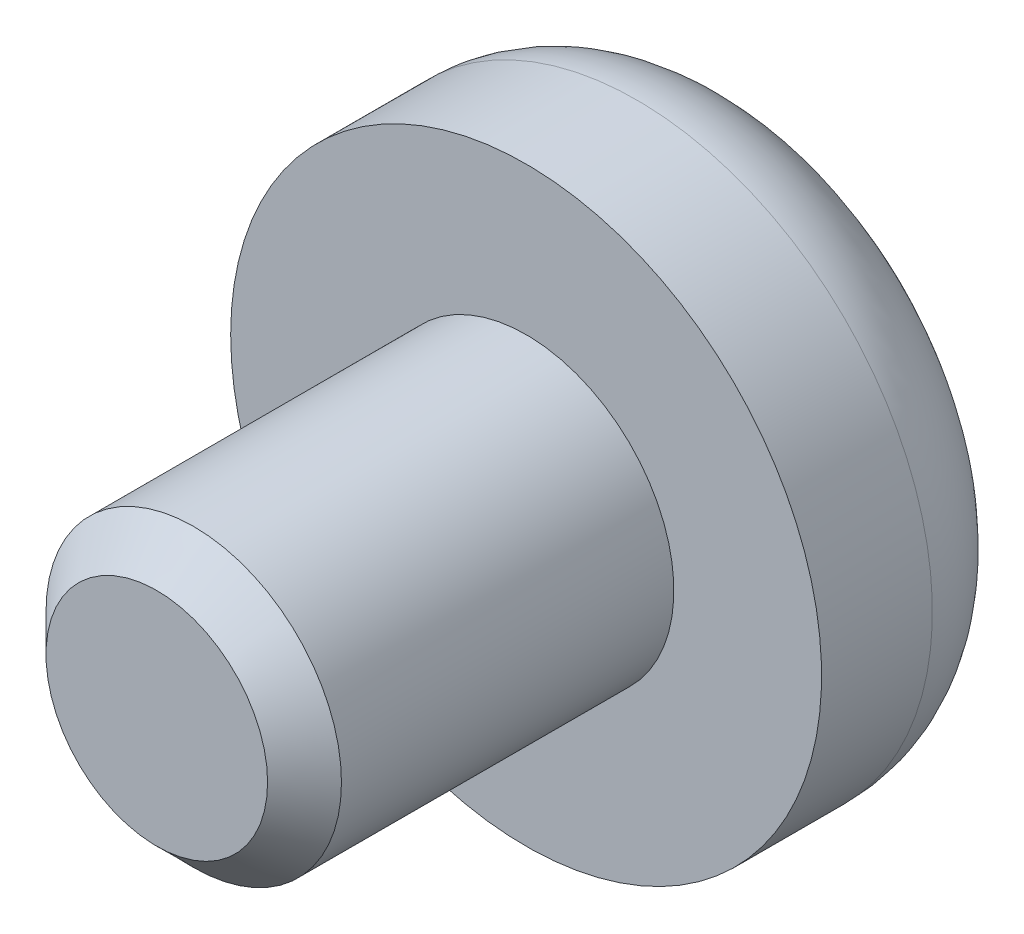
ISO-10303-21;
HEADER;
FILE_DESCRIPTION(('STEP AP214'),'2;1');
FILE_NAME('part.step','',(''),(''),'','','');
FILE_SCHEMA(('AUTOMOTIVE_DESIGN { 1 0 10303 214 1 1 1 1 }'));
ENDSEC;
DATA;
#1=APPLICATION_CONTEXT('core data for automotive mechanical design processes');
#2=APPLICATION_PROTOCOL_DEFINITION('international standard','automotive_design',2000,#1);
#3=PRODUCT_CONTEXT('',#1,'mechanical');
#4=PRODUCT('Part','Part','',(#3));
#5=PRODUCT_RELATED_PRODUCT_CATEGORY('part','',(#4));
#6=PRODUCT_DEFINITION_FORMATION('','',#4);
#7=PRODUCT_DEFINITION_CONTEXT('part definition',#1,'design');
#8=PRODUCT_DEFINITION('design','',#6,#7);
#9=PRODUCT_DEFINITION_SHAPE('','',#8);
#10=(LENGTH_UNIT() NAMED_UNIT(*) SI_UNIT(.MILLI.,.METRE.));
#11=(NAMED_UNIT(*) PLANE_ANGLE_UNIT() SI_UNIT($,.RADIAN.));
#12=(NAMED_UNIT(*) SI_UNIT($,.STERADIAN.) SOLID_ANGLE_UNIT());
#13=UNCERTAINTY_MEASURE_WITH_UNIT(LENGTH_MEASURE(1.E-05),#10,'distance_accuracy_value','');
#14=(GEOMETRIC_REPRESENTATION_CONTEXT(3) GLOBAL_UNCERTAINTY_ASSIGNED_CONTEXT((#13)) GLOBAL_UNIT_ASSIGNED_CONTEXT((#10,
#11,#12)) REPRESENTATION_CONTEXT('',''));
#15=CARTESIAN_POINT('',(0.,0.,0.));
#16=DIRECTION('',(0.,0.,1.));
#17=DIRECTION('',(1.,0.,0.));
#18=AXIS2_PLACEMENT_3D('',#15,#16,#17);
#19=CARTESIAN_POINT('',(0.,0.,5.));
#20=DIRECTION('',(0.,0.,-1.));
#21=DIRECTION('',(-1.,0.,0.));
#22=AXIS2_PLACEMENT_3D('',#19,#20,#21);
#23=CYLINDRICAL_SURFACE('',#22,2.);
#24=CARTESIAN_POINT('',(0.,0.,4.5));
#25=DIRECTION('',(0.,0.,1.));
#26=DIRECTION('',(1.,0.,0.));
#27=AXIS2_PLACEMENT_3D('',#24,#25,#26);
#28=CIRCLE('',#27,2.);
#29=CARTESIAN_POINT('',(2.,0.,4.5));
#30=VERTEX_POINT('',#29);
#31=EDGE_CURVE('E10',#30,#30,#28,.F.);
#32=ORIENTED_EDGE('',*,*,#31,.T.);
#33=EDGE_LOOP('',(#32));
#34=FACE_BOUND('',#33,.T.);
#35=CARTESIAN_POINT('',(0.,0.,0.));
#36=DIRECTION('',(0.,0.,-1.));
#37=DIRECTION('',(-1.,0.,0.));
#38=AXIS2_PLACEMENT_3D('',#35,#36,#37);
#39=CIRCLE('',#38,2.);
#40=CARTESIAN_POINT('',(-2.,0.,0.));
#41=VERTEX_POINT('',#40);
#42=EDGE_CURVE('E51',#41,#41,#39,.T.);
#43=ORIENTED_EDGE('',*,*,#42,.F.);
#44=EDGE_LOOP('',(#43));
#45=FACE_BOUND('',#44,.T.);
#46=ADVANCED_FACE('F31',(#34,#45),#23,.T.);
#47=CARTESIAN_POINT('',(0.,0.,5.));
#48=DIRECTION('',(0.,0.,1.));
#49=DIRECTION('',(1.,0.,0.));
#50=AXIS2_PLACEMENT_3D('',#47,#48,#49);
#51=PLANE('',#50);
#52=CARTESIAN_POINT('',(0.,0.,5.));
#53=DIRECTION('',(0.,0.,1.));
#54=DIRECTION('',(1.,0.,0.));
#55=AXIS2_PLACEMENT_3D('',#52,#53,#54);
#56=CIRCLE('',#55,1.5);
#57=CARTESIAN_POINT('',(1.5,0.,5.));
#58=VERTEX_POINT('',#57);
#59=EDGE_CURVE('E38',#58,#58,#56,.T.);
#60=ORIENTED_EDGE('',*,*,#59,.T.);
#61=EDGE_LOOP('',(#60));
#62=FACE_BOUND('',#61,.T.);
#63=ADVANCED_FACE('F63',(#62),#51,.T.);
#64=CARTESIAN_POINT('',(0.,0.,0.));
#65=DIRECTION('',(0.,0.,-1.));
#66=DIRECTION('',(-1.,0.,0.));
#67=AXIS2_PLACEMENT_3D('',#64,#65,#66);
#68=PLANE('',#67);
#69=CARTESIAN_POINT('',(0.,0.,0.));
#70=DIRECTION('',(0.,0.,-1.));
#71=DIRECTION('',(-1.,0.,0.));
#72=AXIS2_PLACEMENT_3D('',#69,#70,#71);
#73=CIRCLE('',#72,4.);
#74=CARTESIAN_POINT('',(-4.,0.,0.));
#75=VERTEX_POINT('',#74);
#76=EDGE_CURVE('E54',#75,#75,#73,.T.);
#77=ORIENTED_EDGE('',*,*,#76,.F.);
#78=EDGE_LOOP('',(#77));
#79=FACE_BOUND('',#78,.T.);
#80=ORIENTED_EDGE('',*,*,#42,.T.);
#81=EDGE_LOOP('',(#80));
#82=FACE_BOUND('',#81,.T.);
#83=ADVANCED_FACE('F60',(#79,#82),#68,.F.);
#84=CARTESIAN_POINT('',(0.,0.,-3.));
#85=DIRECTION('',(0.,0.,1.));
#86=DIRECTION('',(1.,0.,0.));
#87=AXIS2_PLACEMENT_3D('',#84,#85,#86);
#88=CYLINDRICAL_SURFACE('',#87,4.);
#89=CARTESIAN_POINT('',(0.,0.,-1.5));
#90=DIRECTION('',(0.,0.,-1.));
#91=DIRECTION('',(-1.,0.,0.));
#92=AXIS2_PLACEMENT_3D('',#89,#90,#91);
#93=CIRCLE('',#92,4.);
#94=CARTESIAN_POINT('',(-4.,0.,-1.5));
#95=VERTEX_POINT('',#94);
#96=EDGE_CURVE('E42',#95,#95,#93,.F.);
#97=ORIENTED_EDGE('',*,*,#96,.T.);
#98=EDGE_LOOP('',(#97));
#99=FACE_BOUND('',#98,.T.);
#100=ORIENTED_EDGE('',*,*,#76,.T.);
#101=EDGE_LOOP('',(#100));
#102=FACE_BOUND('',#101,.T.);
#103=ADVANCED_FACE('F58',(#99,#102),#88,.T.);
#104=CARTESIAN_POINT('',(0.,0.,-3.));
#105=DIRECTION('',(0.,0.,-1.));
#106=DIRECTION('',(-1.,0.,0.));
#107=AXIS2_PLACEMENT_3D('',#104,#105,#106);
#108=PLANE('',#107);
#109=CARTESIAN_POINT('',(0.,0.,-3.));
#110=DIRECTION('',(0.,0.,-1.));
#111=DIRECTION('',(-1.,0.,0.));
#112=AXIS2_PLACEMENT_3D('',#109,#110,#111);
#113=CIRCLE('',#112,2.5);
#114=CARTESIAN_POINT('',(-2.5,0.,-3.));
#115=VERTEX_POINT('',#114);
#116=EDGE_CURVE('E46',#115,#115,#113,.T.);
#117=ORIENTED_EDGE('',*,*,#116,.T.);
#118=EDGE_LOOP('',(#117));
#119=FACE_BOUND('',#118,.T.);
#120=ADVANCED_FACE('F76',(#119),#108,.T.);
#121=CARTESIAN_POINT('',(0.,0.,-1.5));
#122=DIRECTION('',(0.,0.,-1.));
#123=DIRECTION('',(-1.,0.,0.));
#124=AXIS2_PLACEMENT_3D('',#121,#122,#123);
#125=TOROIDAL_SURFACE('',#124,2.5,1.5);
#126=ORIENTED_EDGE('',*,*,#96,.F.);
#127=EDGE_LOOP('',(#126));
#128=FACE_BOUND('',#127,.T.);
#129=ORIENTED_EDGE('',*,*,#116,.F.);
#130=EDGE_LOOP('',(#129));
#131=FACE_BOUND('',#130,.T.);
#132=ADVANCED_FACE('F74',(#128,#131),#125,.T.);
#133=CARTESIAN_POINT('',(0.,0.,5.));
#134=DIRECTION('',(0.,0.,-1.));
#135=DIRECTION('',(-1.,0.,0.));
#136=AXIS2_PLACEMENT_3D('',#133,#134,#135);
#137=CONICAL_SURFACE('',#136,1.5,0.785398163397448);
#138=ORIENTED_EDGE('',*,*,#31,.F.);
#139=EDGE_LOOP('',(#138));
#140=FACE_BOUND('',#139,.T.);
#141=ORIENTED_EDGE('',*,*,#59,.F.);
#142=EDGE_LOOP('',(#141));
#143=FACE_BOUND('',#142,.T.);
#144=ADVANCED_FACE('F33',(#140,#143),#137,.T.);
#145=CLOSED_SHELL('',(#46,#63,#83,#103,#120,#132,#144));
#146=MANIFOLD_SOLID_BREP('B2',#145);
#147=ADVANCED_BREP_SHAPE_REPRESENTATION('',(#18,#146),#14);
#148=SHAPE_DEFINITION_REPRESENTATION(#9,#147);
ENDSEC;
END-ISO-10303-21;
